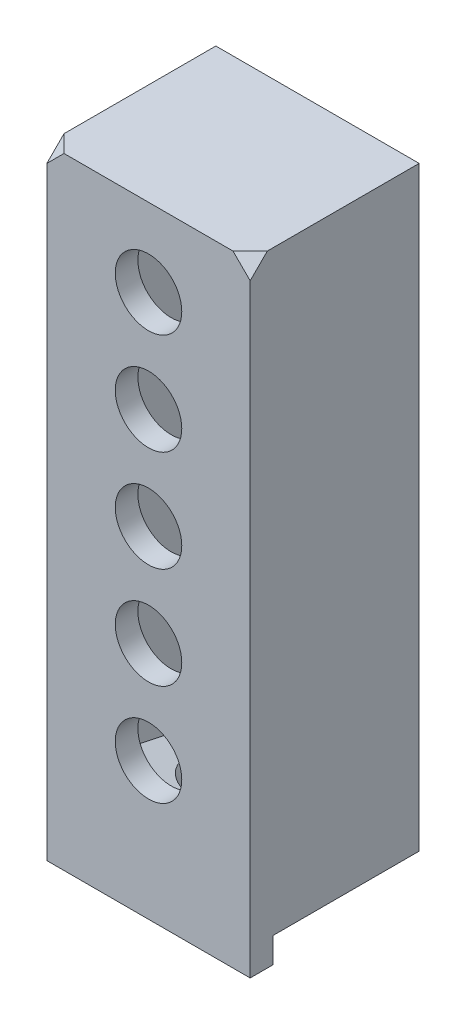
ISO-10303-21;
HEADER;
FILE_DESCRIPTION(('STEP AP214'),'2;1');
FILE_NAME('part.step','',(''),(''),'','','');
FILE_SCHEMA(('AUTOMOTIVE_DESIGN { 1 0 10303 214 1 1 1 1 }'));
ENDSEC;
DATA;
#1=APPLICATION_CONTEXT('core data for automotive mechanical design processes');
#2=APPLICATION_PROTOCOL_DEFINITION('international standard','automotive_design',2000,#1);
#3=PRODUCT_CONTEXT('',#1,'mechanical');
#4=PRODUCT('Part','Part','',(#3));
#5=PRODUCT_RELATED_PRODUCT_CATEGORY('part','',(#4));
#6=PRODUCT_DEFINITION_FORMATION('','',#4);
#7=PRODUCT_DEFINITION_CONTEXT('part definition',#1,'design');
#8=PRODUCT_DEFINITION('design','',#6,#7);
#9=PRODUCT_DEFINITION_SHAPE('','',#8);
#10=(LENGTH_UNIT() NAMED_UNIT(*) SI_UNIT(.MILLI.,.METRE.));
#11=(NAMED_UNIT(*) PLANE_ANGLE_UNIT() SI_UNIT($,.RADIAN.));
#12=(NAMED_UNIT(*) SI_UNIT($,.STERADIAN.) SOLID_ANGLE_UNIT());
#13=UNCERTAINTY_MEASURE_WITH_UNIT(LENGTH_MEASURE(1.E-05),#10,'distance_accuracy_value','');
#14=(GEOMETRIC_REPRESENTATION_CONTEXT(3) GLOBAL_UNCERTAINTY_ASSIGNED_CONTEXT((#13)) GLOBAL_UNIT_ASSIGNED_CONTEXT((#10,
#11,#12)) REPRESENTATION_CONTEXT('',''));
#15=CARTESIAN_POINT('',(0.,0.,0.));
#16=DIRECTION('',(0.,0.,1.));
#17=DIRECTION('',(1.,0.,0.));
#18=AXIS2_PLACEMENT_3D('',#15,#16,#17);
#19=CARTESIAN_POINT('',(0.,0.,0.));
#20=DIRECTION('',(0.,0.,-1.));
#21=DIRECTION('',(-1.,0.,0.));
#22=AXIS2_PLACEMENT_3D('',#19,#20,#21);
#23=PLANE('',#22);
#24=CARTESIAN_POINT('',(0.,7.62,0.));
#25=DIRECTION('',(0.,0.,1.));
#26=DIRECTION('',(1.,0.,0.));
#27=AXIS2_PLACEMENT_3D('',#24,#25,#26);
#28=CIRCLE('',#27,2.5);
#29=CARTESIAN_POINT('',(2.5,7.62,0.));
#30=VERTEX_POINT('',#29);
#31=EDGE_CURVE('E293',#30,#30,#28,.T.);
#32=ORIENTED_EDGE('',*,*,#31,.T.);
#33=EDGE_LOOP('',(#32));
#34=FACE_BOUND('',#33,.T.);
#35=CARTESIAN_POINT('',(0.,-7.62,0.));
#36=DIRECTION('',(0.,0.,1.));
#37=DIRECTION('',(1.,0.,0.));
#38=AXIS2_PLACEMENT_3D('',#35,#36,#37);
#39=CIRCLE('',#38,2.5);
#40=CARTESIAN_POINT('',(2.5,-7.62,0.));
#41=VERTEX_POINT('',#40);
#42=EDGE_CURVE('E305',#41,#41,#39,.T.);
#43=ORIENTED_EDGE('',*,*,#42,.T.);
#44=EDGE_LOOP('',(#43));
#45=FACE_BOUND('',#44,.T.);
#46=CARTESIAN_POINT('',(0.,-15.24,0.));
#47=DIRECTION('',(0.,0.,1.));
#48=DIRECTION('',(1.,0.,0.));
#49=AXIS2_PLACEMENT_3D('',#46,#47,#48);
#50=CIRCLE('',#49,2.5);
#51=CARTESIAN_POINT('',(2.5,-15.24,0.));
#52=VERTEX_POINT('',#51);
#53=EDGE_CURVE('E311',#52,#52,#50,.T.);
#54=ORIENTED_EDGE('',*,*,#53,.T.);
#55=EDGE_LOOP('',(#54));
#56=FACE_BOUND('',#55,.T.);
#57=CARTESIAN_POINT('',(0.,0.,0.));
#58=DIRECTION('',(0.,0.,1.));
#59=DIRECTION('',(1.,0.,0.));
#60=AXIS2_PLACEMENT_3D('',#57,#58,#59);
#61=CIRCLE('',#60,2.5);
#62=CARTESIAN_POINT('',(2.5,0.,0.));
#63=VERTEX_POINT('',#62);
#64=EDGE_CURVE('E299',#63,#63,#61,.T.);
#65=ORIENTED_EDGE('',*,*,#64,.T.);
#66=EDGE_LOOP('',(#65));
#67=FACE_BOUND('',#66,.T.);
#68=CARTESIAN_POINT('',(0.,15.24,0.));
#69=DIRECTION('',(0.,0.,1.));
#70=DIRECTION('',(1.,0.,0.));
#71=AXIS2_PLACEMENT_3D('',#68,#69,#70);
#72=CIRCLE('',#71,2.5);
#73=CARTESIAN_POINT('',(2.5,15.24,0.));
#74=VERTEX_POINT('',#73);
#75=EDGE_CURVE('E282',#74,#74,#72,.T.);
#76=ORIENTED_EDGE('',*,*,#75,.T.);
#77=EDGE_LOOP('',(#76));
#78=FACE_BOUND('',#77,.T.);
#79=DIRECTION('',(0.,1.,0.));
#80=VECTOR('',#79,1.);
#81=CARTESIAN_POINT('',(6.35,-22.3755,0.));
#82=LINE('',#81,#80);
#83=CARTESIAN_POINT('',(6.34999999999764,-19.3375110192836,0.));
#84=VERTEX_POINT('',#83);
#85=CARTESIAN_POINT('',(6.35,19.812,0.));
#86=VERTEX_POINT('',#85);
#87=EDGE_CURVE('E320',#84,#86,#82,.T.);
#88=ORIENTED_EDGE('',*,*,#87,.F.);
#89=DIRECTION('',(-1.,0.,0.));
#90=VECTOR('',#89,1.);
#91=CARTESIAN_POINT('',(500000.,-19.3375110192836,0.));
#92=LINE('',#91,#90);
#93=CARTESIAN_POINT('',(-6.37000000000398,-19.3375110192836,0.));
#94=VERTEX_POINT('',#93);
#95=EDGE_CURVE('E240',#84,#94,#92,.T.);
#96=ORIENTED_EDGE('',*,*,#95,.T.);
#97=CARTESIAN_POINT('',(-6.37000000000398,-20.6344110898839,0.));
#98=DIRECTION('',(0.,0.,-1.));
#99=DIRECTION('',(0.,-1.,0.));
#100=AXIS2_PLACEMENT_3D('',#97,#98,#99);
#101=ELLIPSE('',#100,1.29690007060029,1.27);
#102=CARTESIAN_POINT('',(-7.64,-20.6344110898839,0.));
#103=VERTEX_POINT('',#102);
#104=EDGE_CURVE('E76',#94,#103,#101,.F.);
#105=ORIENTED_EDGE('',*,*,#104,.T.);
#106=DIRECTION('',(0.,1.,0.));
#107=VECTOR('',#106,1.);
#108=CARTESIAN_POINT('',(-7.64,-15.5275110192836,0.));
#109=LINE('',#108,#107);
#110=CARTESIAN_POINT('',(-7.64,-15.5275110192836,0.));
#111=VERTEX_POINT('',#110);
#112=EDGE_CURVE('E83',#103,#111,#109,.T.);
#113=ORIENTED_EDGE('',*,*,#112,.T.);
#114=DIRECTION('',(-1.,0.,0.));
#115=VECTOR('',#114,1.);
#116=CARTESIAN_POINT('',(7.64100000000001,-15.5275110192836,0.));
#117=LINE('',#116,#115);
#118=CARTESIAN_POINT('',(-6.34999999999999,-15.5275110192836,0.));
#119=VERTEX_POINT('',#118);
#120=EDGE_CURVE('E194',#119,#111,#117,.T.);
#121=ORIENTED_EDGE('',*,*,#120,.F.);
#122=DIRECTION('',(0.,-1.,0.));
#123=VECTOR('',#122,1.);
#124=CARTESIAN_POINT('',(-6.35,-22.3755,0.));
#125=LINE('',#124,#123);
#126=CARTESIAN_POINT('',(-6.35,19.812,0.));
#127=VERTEX_POINT('',#126);
#128=EDGE_CURVE('E207',#127,#119,#125,.T.);
#129=ORIENTED_EDGE('',*,*,#128,.F.);
#130=DIRECTION('',(-1.,0.,0.));
#131=VECTOR('',#130,1.);
#132=CARTESIAN_POINT('',(-6.35,19.812,0.));
#133=LINE('',#132,#131);
#134=EDGE_CURVE('E322',#86,#127,#133,.T.);
#135=ORIENTED_EDGE('',*,*,#134,.F.);
#136=EDGE_LOOP('',(#88,#96,#105,#113,#121,#129,#135));
#137=FACE_BOUND('',#136,.T.);
#138=ADVANCED_FACE('F68',(#34,#45,#56,#67,#78,#137),#23,.T.);
#139=CARTESIAN_POINT('',(-6.35,19.812,-11.));
#140=DIRECTION('',(-1.,0.,0.));
#141=DIRECTION('',(0.,-1.,0.));
#142=AXIS2_PLACEMENT_3D('',#139,#140,#141);
#143=PLANE('',#142);
#144=DIRECTION('',(0.,0.,1.));
#145=VECTOR('',#144,1.);
#146=CARTESIAN_POINT('',(-6.34999999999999,-15.5275110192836,-3.81));
#147=LINE('',#146,#145);
#148=CARTESIAN_POINT('',(-6.34999999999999,-15.5275110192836,-3.81));
#149=VERTEX_POINT('',#148);
#150=EDGE_CURVE('E191',#149,#119,#147,.T.);
#151=ORIENTED_EDGE('',*,*,#150,.F.);
#152=DIRECTION('',(0.,1.,0.));
#153=VECTOR('',#152,1.);
#154=CARTESIAN_POINT('',(-6.34999999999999,-15.5275110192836,-3.81));
#155=LINE('',#154,#153);
#156=CARTESIAN_POINT('',(-6.35,-20.1258308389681,-3.81));
#157=VERTEX_POINT('',#156);
#158=EDGE_CURVE('E198',#157,#149,#155,.T.);
#159=ORIENTED_EDGE('',*,*,#158,.F.);
#160=DIRECTION('',(0.,0.202616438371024,0.979258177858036));
#161=VECTOR('',#160,1.);
#162=CARTESIAN_POINT('',(-6.35,-19.3375110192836,0.));
#163=LINE('',#162,#161);
#164=CARTESIAN_POINT('',(-6.35,-21.6135,-11.));
#165=VERTEX_POINT('',#164);
#166=EDGE_CURVE('E237',#165,#157,#163,.T.);
#167=ORIENTED_EDGE('',*,*,#166,.F.);
#168=DIRECTION('',(0.,-1.,0.));
#169=VECTOR('',#168,1.);
#170=CARTESIAN_POINT('',(-6.35,19.812,-11.));
#171=LINE('',#170,#169);
#172=CARTESIAN_POINT('',(-6.35,19.812,-11.));
#173=VERTEX_POINT('',#172);
#174=EDGE_CURVE('E239',#173,#165,#171,.T.);
#175=ORIENTED_EDGE('',*,*,#174,.F.);
#176=DIRECTION('',(0.,0.,1.));
#177=VECTOR('',#176,1.);
#178=CARTESIAN_POINT('',(-6.35,19.812,-11.));
#179=LINE('',#178,#177);
#180=EDGE_CURVE('E255',#173,#127,#179,.T.);
#181=ORIENTED_EDGE('',*,*,#180,.T.);
#182=ORIENTED_EDGE('',*,*,#128,.T.);
#183=EDGE_LOOP('',(#151,#159,#167,#175,#181,#182));
#184=FACE_BOUND('',#183,.T.);
#185=ADVANCED_FACE('F205',(#184),#143,.F.);
#186=CARTESIAN_POINT('',(6.34999999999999,19.812,-11.));
#187=DIRECTION('',(1.,0.,0.));
#188=DIRECTION('',(0.,1.,0.));
#189=AXIS2_PLACEMENT_3D('',#186,#187,#188);
#190=PLANE('',#189);
#191=DIRECTION('',(0.,0.202616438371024,0.979258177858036));
#192=VECTOR('',#191,1.);
#193=CARTESIAN_POINT('',(6.34999999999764,-19.3375110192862,-1.22378209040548E-11));
#194=LINE('',#193,#192);
#195=CARTESIAN_POINT('',(6.34999999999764,-21.6135,-11.));
#196=VERTEX_POINT('',#195);
#197=EDGE_CURVE('E236',#196,#84,#194,.T.);
#198=ORIENTED_EDGE('',*,*,#197,.T.);
#199=ORIENTED_EDGE('',*,*,#87,.T.);
#200=DIRECTION('',(0.,0.,1.));
#201=VECTOR('',#200,1.);
#202=CARTESIAN_POINT('',(6.34999999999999,19.812,-11.));
#203=LINE('',#202,#201);
#204=CARTESIAN_POINT('',(6.34999999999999,19.812,-11.));
#205=VERTEX_POINT('',#204);
#206=EDGE_CURVE('E254',#205,#86,#203,.T.);
#207=ORIENTED_EDGE('',*,*,#206,.F.);
#208=DIRECTION('',(0.,1.,0.));
#209=VECTOR('',#208,1.);
#210=CARTESIAN_POINT('',(6.34999999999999,19.812,-11.));
#211=LINE('',#210,#209);
#212=EDGE_CURVE('E249',#196,#205,#211,.T.);
#213=ORIENTED_EDGE('',*,*,#212,.F.);
#214=EDGE_LOOP('',(#198,#199,#207,#213));
#215=FACE_BOUND('',#214,.T.);
#216=ADVANCED_FACE('F406',(#215),#190,.F.);
#217=CARTESIAN_POINT('',(7.64,19.812,-11.));
#218=DIRECTION('',(1.,0.,0.));
#219=DIRECTION('',(0.,1.,0.));
#220=AXIS2_PLACEMENT_3D('',#217,#218,#219);
#221=PLANE('',#220);
#222=DIRECTION('',(0.,0.,1.));
#223=VECTOR('',#222,1.);
#224=CARTESIAN_POINT('',(7.64,21.102,-11.));
#225=LINE('',#224,#223);
#226=CARTESIAN_POINT('',(7.64,21.102,-11.));
#227=VERTEX_POINT('',#226);
#228=CARTESIAN_POINT('',(7.64,21.102,0.409999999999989));
#229=VERTEX_POINT('',#228);
#230=EDGE_CURVE('E283',#227,#229,#225,.T.);
#231=ORIENTED_EDGE('',*,*,#230,.T.);
#232=DIRECTION('',(0.,-0.707106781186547,0.707106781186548));
#233=VECTOR('',#232,1.);
#234=CARTESIAN_POINT('',(7.63999999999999,26.162,-4.65000000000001));
#235=LINE('',#234,#233);
#236=CARTESIAN_POINT('',(7.64,19.812,1.7));
#237=VERTEX_POINT('',#236);
#238=EDGE_CURVE('E339',#229,#237,#235,.T.);
#239=ORIENTED_EDGE('',*,*,#238,.T.);
#240=DIRECTION('',(0.,1.,0.));
#241=VECTOR('',#240,1.);
#242=CARTESIAN_POINT('',(7.64,19.812,1.7));
#243=LINE('',#242,#241);
#244=CARTESIAN_POINT('',(7.64,-25.5705,1.7));
#245=VERTEX_POINT('',#244);
#246=EDGE_CURVE('E275',#245,#237,#243,.T.);
#247=ORIENTED_EDGE('',*,*,#246,.F.);
#248=DIRECTION('',(0.,0.,1.));
#249=VECTOR('',#248,1.);
#250=CARTESIAN_POINT('',(7.64,-25.5705,1.7));
#251=LINE('',#250,#249);
#252=CARTESIAN_POINT('',(7.64,-25.5705,0.));
#253=VERTEX_POINT('',#252);
#254=EDGE_CURVE('E222',#253,#245,#251,.T.);
#255=ORIENTED_EDGE('',*,*,#254,.F.);
#256=DIRECTION('',(0.,1.,0.));
#257=VECTOR('',#256,1.);
#258=CARTESIAN_POINT('',(7.64,-25.5705,0.));
#259=LINE('',#258,#257);
#260=CARTESIAN_POINT('',(7.64,-23.6655,0.));
#261=VERTEX_POINT('',#260);
#262=EDGE_CURVE('E228',#253,#261,#259,.T.);
#263=ORIENTED_EDGE('',*,*,#262,.T.);
#264=DIRECTION('',(0.,0.,1.));
#265=VECTOR('',#264,1.);
#266=CARTESIAN_POINT('',(7.64,-23.6655,-11.));
#267=LINE('',#266,#265);
#268=CARTESIAN_POINT('',(7.64,-23.6655,-11.));
#269=VERTEX_POINT('',#268);
#270=EDGE_CURVE('E286',#269,#261,#267,.T.);
#271=ORIENTED_EDGE('',*,*,#270,.F.);
#272=DIRECTION('',(0.,1.,0.));
#273=VECTOR('',#272,1.);
#274=CARTESIAN_POINT('',(7.64,19.812,-11.));
#275=LINE('',#274,#273);
#276=EDGE_CURVE('E267',#269,#227,#275,.T.);
#277=ORIENTED_EDGE('',*,*,#276,.T.);
#278=EDGE_LOOP('',(#231,#239,#247,#255,#263,#271,#277));
#279=FACE_BOUND('',#278,.T.);
#280=ADVANCED_FACE('F381',(#279),#221,.T.);
#281=CARTESIAN_POINT('',(-6.35,21.102,-11.));
#282=DIRECTION('',(0.,1.,0.));
#283=DIRECTION('',(0.,0.,1.));
#284=AXIS2_PLACEMENT_3D('',#281,#282,#283);
#285=PLANE('',#284);
#286=DIRECTION('',(-1.,0.,0.));
#287=VECTOR('',#286,1.);
#288=CARTESIAN_POINT('',(-6.35,21.102,1.7));
#289=LINE('',#288,#287);
#290=CARTESIAN_POINT('',(6.34999999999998,21.102,1.7));
#291=VERTEX_POINT('',#290);
#292=CARTESIAN_POINT('',(-6.34999999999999,21.102,1.7));
#293=VERTEX_POINT('',#292);
#294=EDGE_CURVE('E264',#291,#293,#289,.T.);
#295=ORIENTED_EDGE('',*,*,#294,.F.);
#296=DIRECTION('',(0.707106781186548,0.,-0.707106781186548));
#297=VECTOR('',#296,1.);
#298=CARTESIAN_POINT('',(6.34999999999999,21.102,1.69999999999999));
#299=LINE('',#298,#297);
#300=EDGE_CURVE('E334',#291,#229,#299,.T.);
#301=ORIENTED_EDGE('',*,*,#300,.T.);
#302=ORIENTED_EDGE('',*,*,#230,.F.);
#303=DIRECTION('',(-1.,0.,0.));
#304=VECTOR('',#303,1.);
#305=CARTESIAN_POINT('',(-6.35,21.102,-11.));
#306=LINE('',#305,#304);
#307=CARTESIAN_POINT('',(-7.64,21.102,-11.));
#308=VERTEX_POINT('',#307);
#309=EDGE_CURVE('E270',#227,#308,#306,.T.);
#310=ORIENTED_EDGE('',*,*,#309,.T.);
#311=DIRECTION('',(0.,0.,1.));
#312=VECTOR('',#311,1.);
#313=CARTESIAN_POINT('',(-7.64,21.102,-11.));
#314=LINE('',#313,#312);
#315=CARTESIAN_POINT('',(-7.64,21.102,0.409999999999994));
#316=VERTEX_POINT('',#315);
#317=EDGE_CURVE('E279',#308,#316,#314,.T.);
#318=ORIENTED_EDGE('',*,*,#317,.T.);
#319=DIRECTION('',(0.707106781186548,0.,0.707106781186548));
#320=VECTOR('',#319,1.);
#321=CARTESIAN_POINT('',(-12.7,21.102,-4.65));
#322=LINE('',#321,#320);
#323=EDGE_CURVE('E331',#316,#293,#322,.T.);
#324=ORIENTED_EDGE('',*,*,#323,.T.);
#325=EDGE_LOOP('',(#295,#301,#302,#310,#318,#324));
#326=FACE_BOUND('',#325,.T.);
#327=ADVANCED_FACE('F366',(#326),#285,.T.);
#328=CARTESIAN_POINT('',(-7.64,19.812,-11.));
#329=DIRECTION('',(-1.,0.,0.));
#330=DIRECTION('',(0.,-1.,0.));
#331=AXIS2_PLACEMENT_3D('',#328,#329,#330);
#332=PLANE('',#331);
#333=ORIENTED_EDGE('',*,*,#112,.F.);
#334=DIRECTION('',(0.,0.202616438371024,0.979258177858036));
#335=VECTOR('',#334,1.);
#336=CARTESIAN_POINT('',(-7.64,-21.3694887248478,-3.5526771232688));
#337=LINE('',#336,#335);
#338=CARTESIAN_POINT('',(-7.64,-21.4227309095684,-3.81));
#339=VERTEX_POINT('',#338);
#340=EDGE_CURVE('E353',#103,#339,#337,.F.);
#341=ORIENTED_EDGE('',*,*,#340,.T.);
#342=DIRECTION('',(0.,-1.,0.));
#343=VECTOR('',#342,1.);
#344=CARTESIAN_POINT('',(-7.64,-15.5275110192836,-3.81));
#345=LINE('',#344,#343);
#346=CARTESIAN_POINT('',(-7.64,-15.5275110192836,-3.81));
#347=VERTEX_POINT('',#346);
#348=EDGE_CURVE('E90',#347,#339,#345,.T.);
#349=ORIENTED_EDGE('',*,*,#348,.F.);
#350=DIRECTION('',(0.,0.,-1.));
#351=VECTOR('',#350,1.);
#352=CARTESIAN_POINT('',(-7.64,-15.5275110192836,-3.81));
#353=LINE('',#352,#351);
#354=EDGE_CURVE('E193',#111,#347,#353,.T.);
#355=ORIENTED_EDGE('',*,*,#354,.F.);
#356=EDGE_LOOP('',(#333,#341,#349,#355));
#357=FACE_BOUND('',#356,.T.);
#358=DIRECTION('',(0.,-1.,0.));
#359=VECTOR('',#358,1.);
#360=CARTESIAN_POINT('',(-7.64,19.812,1.7));
#361=LINE('',#360,#359);
#362=CARTESIAN_POINT('',(-7.64,19.812,1.7));
#363=VERTEX_POINT('',#362);
#364=CARTESIAN_POINT('',(-7.64,-25.5705,1.7));
#365=VERTEX_POINT('',#364);
#366=EDGE_CURVE('E257',#363,#365,#361,.T.);
#367=ORIENTED_EDGE('',*,*,#366,.F.);
#368=DIRECTION('',(0.,0.707106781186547,-0.707106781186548));
#369=VECTOR('',#368,1.);
#370=CARTESIAN_POINT('',(-7.64,26.162,-4.65000000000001));
#371=LINE('',#370,#369);
#372=EDGE_CURVE('E328',#363,#316,#371,.T.);
#373=ORIENTED_EDGE('',*,*,#372,.T.);
#374=ORIENTED_EDGE('',*,*,#317,.F.);
#375=DIRECTION('',(0.,-1.,0.));
#376=VECTOR('',#375,1.);
#377=CARTESIAN_POINT('',(-7.64,19.812,-11.));
#378=LINE('',#377,#376);
#379=CARTESIAN_POINT('',(-7.64,-23.6655,-11.));
#380=VERTEX_POINT('',#379);
#381=EDGE_CURVE('E260',#308,#380,#378,.T.);
#382=ORIENTED_EDGE('',*,*,#381,.T.);
#383=DIRECTION('',(0.,0.,1.));
#384=VECTOR('',#383,1.);
#385=CARTESIAN_POINT('',(-7.64,-23.6655,-11.));
#386=LINE('',#385,#384);
#387=CARTESIAN_POINT('',(-7.64,-23.6655,0.));
#388=VERTEX_POINT('',#387);
#389=EDGE_CURVE('E273',#380,#388,#386,.T.);
#390=ORIENTED_EDGE('',*,*,#389,.T.);
#391=DIRECTION('',(0.,1.,0.));
#392=VECTOR('',#391,1.);
#393=CARTESIAN_POINT('',(-7.64,-25.5705,0.));
#394=LINE('',#393,#392);
#395=CARTESIAN_POINT('',(-7.64,-25.5705,0.));
#396=VERTEX_POINT('',#395);
#397=EDGE_CURVE('E233',#396,#388,#394,.T.);
#398=ORIENTED_EDGE('',*,*,#397,.F.);
#399=DIRECTION('',(0.,0.,-1.));
#400=VECTOR('',#399,1.);
#401=CARTESIAN_POINT('',(-7.64,-25.5705,1.7));
#402=LINE('',#401,#400);
#403=EDGE_CURVE('E217',#365,#396,#402,.T.);
#404=ORIENTED_EDGE('',*,*,#403,.F.);
#405=EDGE_LOOP('',(#367,#373,#374,#382,#390,#398,#404));
#406=FACE_BOUND('',#405,.T.);
#407=ADVANCED_FACE('F360',(#357,#406),#332,.T.);
#408=CARTESIAN_POINT('',(0.,0.,1.7));
#409=DIRECTION('',(0.,0.,-1.));
#410=DIRECTION('',(-1.,0.,0.));
#411=AXIS2_PLACEMENT_3D('',#408,#409,#410);
#412=PLANE('',#411);
#413=DIRECTION('',(0.707106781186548,-0.707106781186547,0.));
#414=VECTOR('',#413,1.);
#415=CARTESIAN_POINT('',(13.726,13.726,1.7));
#416=LINE('',#415,#414);
#417=EDGE_CURVE('E337',#291,#237,#416,.T.);
#418=ORIENTED_EDGE('',*,*,#417,.F.);
#419=ORIENTED_EDGE('',*,*,#294,.T.);
#420=DIRECTION('',(0.707106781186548,0.707106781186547,0.));
#421=VECTOR('',#420,1.);
#422=CARTESIAN_POINT('',(-13.726,13.726,1.7));
#423=LINE('',#422,#421);
#424=EDGE_CURVE('E325',#363,#293,#423,.T.);
#425=ORIENTED_EDGE('',*,*,#424,.F.);
#426=ORIENTED_EDGE('',*,*,#366,.T.);
#427=DIRECTION('',(-1.,0.,0.));
#428=VECTOR('',#427,1.);
#429=CARTESIAN_POINT('',(-7.64,-25.5705,1.7));
#430=LINE('',#429,#428);
#431=EDGE_CURVE('E225',#245,#365,#430,.T.);
#432=ORIENTED_EDGE('',*,*,#431,.F.);
#433=ORIENTED_EDGE('',*,*,#246,.T.);
#434=EDGE_LOOP('',(#418,#419,#425,#426,#432,#433));
#435=FACE_BOUND('',#434,.T.);
#436=CARTESIAN_POINT('',(0.,-15.24,1.7));
#437=DIRECTION('',(0.,0.,1.));
#438=DIRECTION('',(1.,0.,0.));
#439=AXIS2_PLACEMENT_3D('',#436,#437,#438);
#440=CIRCLE('',#439,2.5);
#441=CARTESIAN_POINT('',(2.5,-15.24,1.7));
#442=VERTEX_POINT('',#441);
#443=EDGE_CURVE('E314',#442,#442,#440,.T.);
#444=ORIENTED_EDGE('',*,*,#443,.F.);
#445=EDGE_LOOP('',(#444));
#446=FACE_BOUND('',#445,.T.);
#447=CARTESIAN_POINT('',(0.,-7.62,1.7));
#448=DIRECTION('',(0.,0.,1.));
#449=DIRECTION('',(1.,0.,0.));
#450=AXIS2_PLACEMENT_3D('',#447,#448,#449);
#451=CIRCLE('',#450,2.5);
#452=CARTESIAN_POINT('',(2.5,-7.62,1.7));
#453=VERTEX_POINT('',#452);
#454=EDGE_CURVE('E308',#453,#453,#451,.T.);
#455=ORIENTED_EDGE('',*,*,#454,.F.);
#456=EDGE_LOOP('',(#455));
#457=FACE_BOUND('',#456,.T.);
#458=CARTESIAN_POINT('',(0.,0.,1.7));
#459=DIRECTION('',(0.,0.,1.));
#460=DIRECTION('',(1.,0.,0.));
#461=AXIS2_PLACEMENT_3D('',#458,#459,#460);
#462=CIRCLE('',#461,2.5);
#463=CARTESIAN_POINT('',(2.5,0.,1.7));
#464=VERTEX_POINT('',#463);
#465=EDGE_CURVE('E302',#464,#464,#462,.T.);
#466=ORIENTED_EDGE('',*,*,#465,.F.);
#467=EDGE_LOOP('',(#466));
#468=FACE_BOUND('',#467,.T.);
#469=CARTESIAN_POINT('',(0.,7.62,1.7));
#470=DIRECTION('',(0.,0.,1.));
#471=DIRECTION('',(1.,0.,0.));
#472=AXIS2_PLACEMENT_3D('',#469,#470,#471);
#473=CIRCLE('',#472,2.5);
#474=CARTESIAN_POINT('',(2.5,7.62,1.7));
#475=VERTEX_POINT('',#474);
#476=EDGE_CURVE('E296',#475,#475,#473,.T.);
#477=ORIENTED_EDGE('',*,*,#476,.F.);
#478=EDGE_LOOP('',(#477));
#479=FACE_BOUND('',#478,.T.);
#480=CARTESIAN_POINT('',(0.,15.24,1.7));
#481=DIRECTION('',(0.,0.,1.));
#482=DIRECTION('',(1.,0.,0.));
#483=AXIS2_PLACEMENT_3D('',#480,#481,#482);
#484=CIRCLE('',#483,2.5);
#485=CARTESIAN_POINT('',(2.5,15.24,1.7));
#486=VERTEX_POINT('',#485);
#487=EDGE_CURVE('E290',#486,#486,#484,.T.);
#488=ORIENTED_EDGE('',*,*,#487,.F.);
#489=EDGE_LOOP('',(#488));
#490=FACE_BOUND('',#489,.T.);
#491=ADVANCED_FACE('F365',(#435,#446,#457,#468,#479,#490),#412,.F.);
#492=CARTESIAN_POINT('',(0.,-15.24,1.7));
#493=DIRECTION('',(0.,0.,-1.));
#494=DIRECTION('',(-1.,0.,0.));
#495=AXIS2_PLACEMENT_3D('',#492,#493,#494);
#496=CYLINDRICAL_SURFACE('',#495,2.5);
#497=ORIENTED_EDGE('',*,*,#443,.T.);
#498=EDGE_LOOP('',(#497));
#499=FACE_BOUND('',#498,.T.);
#500=ORIENTED_EDGE('',*,*,#53,.F.);
#501=EDGE_LOOP('',(#500));
#502=FACE_BOUND('',#501,.T.);
#503=ADVANCED_FACE('F530',(#499,#502),#496,.F.);
#504=CARTESIAN_POINT('',(0.,-7.62,1.7));
#505=DIRECTION('',(0.,0.,-1.));
#506=DIRECTION('',(-1.,0.,0.));
#507=AXIS2_PLACEMENT_3D('',#504,#505,#506);
#508=CYLINDRICAL_SURFACE('',#507,2.5);
#509=ORIENTED_EDGE('',*,*,#454,.T.);
#510=EDGE_LOOP('',(#509));
#511=FACE_BOUND('',#510,.T.);
#512=ORIENTED_EDGE('',*,*,#42,.F.);
#513=EDGE_LOOP('',(#512));
#514=FACE_BOUND('',#513,.T.);
#515=ADVANCED_FACE('F604',(#511,#514),#508,.F.);
#516=CARTESIAN_POINT('',(0.,0.,1.7));
#517=DIRECTION('',(0.,0.,-1.));
#518=DIRECTION('',(-1.,0.,0.));
#519=AXIS2_PLACEMENT_3D('',#516,#517,#518);
#520=CYLINDRICAL_SURFACE('',#519,2.5);
#521=ORIENTED_EDGE('',*,*,#465,.T.);
#522=EDGE_LOOP('',(#521));
#523=FACE_BOUND('',#522,.T.);
#524=ORIENTED_EDGE('',*,*,#64,.F.);
#525=EDGE_LOOP('',(#524));
#526=FACE_BOUND('',#525,.T.);
#527=ADVANCED_FACE('F594',(#523,#526),#520,.F.);
#528=CARTESIAN_POINT('',(0.,7.62,1.7));
#529=DIRECTION('',(0.,0.,-1.));
#530=DIRECTION('',(-1.,0.,0.));
#531=AXIS2_PLACEMENT_3D('',#528,#529,#530);
#532=CYLINDRICAL_SURFACE('',#531,2.5);
#533=ORIENTED_EDGE('',*,*,#476,.T.);
#534=EDGE_LOOP('',(#533));
#535=FACE_BOUND('',#534,.T.);
#536=ORIENTED_EDGE('',*,*,#31,.F.);
#537=EDGE_LOOP('',(#536));
#538=FACE_BOUND('',#537,.T.);
#539=ADVANCED_FACE('F584',(#535,#538),#532,.F.);
#540=CARTESIAN_POINT('',(0.,15.24,1.7));
#541=DIRECTION('',(0.,0.,-1.));
#542=DIRECTION('',(-1.,0.,0.));
#543=AXIS2_PLACEMENT_3D('',#540,#541,#542);
#544=CYLINDRICAL_SURFACE('',#543,2.5);
#545=ORIENTED_EDGE('',*,*,#487,.T.);
#546=EDGE_LOOP('',(#545));
#547=FACE_BOUND('',#546,.T.);
#548=ORIENTED_EDGE('',*,*,#75,.F.);
#549=EDGE_LOOP('',(#548));
#550=FACE_BOUND('',#549,.T.);
#551=ADVANCED_FACE('F430',(#547,#550),#544,.F.);
#552=CARTESIAN_POINT('',(-6.34999999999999,-23.6655,-11.));
#553=DIRECTION('',(0.,-1.,0.));
#554=DIRECTION('',(0.,0.,-1.));
#555=AXIS2_PLACEMENT_3D('',#552,#553,#554);
#556=PLANE('',#555);
#557=CARTESIAN_POINT('',(0.,-23.6655,-5.45702234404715));
#558=DIRECTION('',(0.,-1.,0.));
#559=DIRECTION('',(0.,0.,-1.));
#560=AXIS2_PLACEMENT_3D('',#557,#558,#559);
#561=ELLIPSE('',#560,1.73702914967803,1.701);
#562=CARTESIAN_POINT('',(0.465143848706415,-23.6655,-7.12784517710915));
#563=VERTEX_POINT('',#562);
#564=CARTESIAN_POINT('',(-0.465143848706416,-23.6655,-7.12784517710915));
#565=VERTEX_POINT('',#564);
#566=EDGE_CURVE('E213',#563,#565,#561,.T.);
#567=ORIENTED_EDGE('',*,*,#566,.F.);
#568=CARTESIAN_POINT('',(0.,-23.6655,-5.72403470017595));
#569=DIRECTION('',(0.,-1.,0.));
#570=DIRECTION('',(0.,0.,-1.));
#571=AXIS2_PLACEMENT_3D('',#568,#569,#570);
#572=ELLIPSE('',#571,1.48453634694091,1.4300363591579);
#573=EDGE_CURVE('E345',#563,#565,#572,.F.);
#574=ORIENTED_EDGE('',*,*,#573,.T.);
#575=EDGE_LOOP('',(#567,#574));
#576=FACE_BOUND('',#575,.T.);
#577=DIRECTION('',(1.,0.,0.));
#578=VECTOR('',#577,1.);
#579=CARTESIAN_POINT('',(-7.64,-23.6655,0.));
#580=LINE('',#579,#578);
#581=EDGE_CURVE('E216',#388,#261,#580,.T.);
#582=ORIENTED_EDGE('',*,*,#581,.F.);
#583=ORIENTED_EDGE('',*,*,#389,.F.);
#584=DIRECTION('',(1.,0.,0.));
#585=VECTOR('',#584,1.);
#586=CARTESIAN_POINT('',(-6.34999999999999,-23.6655,-11.));
#587=LINE('',#586,#585);
#588=EDGE_CURVE('E263',#380,#269,#587,.T.);
#589=ORIENTED_EDGE('',*,*,#588,.T.);
#590=ORIENTED_EDGE('',*,*,#270,.T.);
#591=EDGE_LOOP('',(#582,#583,#589,#590));
#592=FACE_BOUND('',#591,.T.);
#593=ADVANCED_FACE('F427',(#576,#592),#556,.T.);
#594=CARTESIAN_POINT('',(0.,0.,-11.));
#595=DIRECTION('',(0.,0.,1.));
#596=DIRECTION('',(1.,0.,0.));
#597=AXIS2_PLACEMENT_3D('',#594,#595,#596);
#598=PLANE('',#597);
#599=ORIENTED_EDGE('',*,*,#174,.T.);
#600=DIRECTION('',(-1.,0.,0.));
#601=VECTOR('',#600,1.);
#602=CARTESIAN_POINT('',(500000.,-21.6135,-11.));
#603=LINE('',#602,#601);
#604=EDGE_CURVE('E241',#196,#165,#603,.T.);
#605=ORIENTED_EDGE('',*,*,#604,.F.);
#606=ORIENTED_EDGE('',*,*,#212,.T.);
#607=DIRECTION('',(-1.,0.,0.));
#608=VECTOR('',#607,1.);
#609=CARTESIAN_POINT('',(-6.35,19.812,-11.));
#610=LINE('',#609,#608);
#611=EDGE_CURVE('E251',#205,#173,#610,.T.);
#612=ORIENTED_EDGE('',*,*,#611,.T.);
#613=EDGE_LOOP('',(#599,#605,#606,#612));
#614=FACE_BOUND('',#613,.T.);
#615=ORIENTED_EDGE('',*,*,#381,.F.);
#616=ORIENTED_EDGE('',*,*,#309,.F.);
#617=ORIENTED_EDGE('',*,*,#276,.F.);
#618=ORIENTED_EDGE('',*,*,#588,.F.);
#619=EDGE_LOOP('',(#615,#616,#617,#618));
#620=FACE_BOUND('',#619,.T.);
#621=ADVANCED_FACE('F397',(#614,#620),#598,.F.);
#622=CARTESIAN_POINT('',(-6.35,19.812,-11.));
#623=DIRECTION('',(0.,1.,0.));
#624=DIRECTION('',(0.,0.,1.));
#625=AXIS2_PLACEMENT_3D('',#622,#623,#624);
#626=PLANE('',#625);
#627=ORIENTED_EDGE('',*,*,#134,.T.);
#628=ORIENTED_EDGE('',*,*,#180,.F.);
#629=ORIENTED_EDGE('',*,*,#611,.F.);
#630=ORIENTED_EDGE('',*,*,#206,.T.);
#631=EDGE_LOOP('',(#627,#628,#629,#630));
#632=FACE_BOUND('',#631,.T.);
#633=ADVANCED_FACE('F389',(#632),#626,.F.);
#634=CARTESIAN_POINT('',(-9.71733333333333,9.71733333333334,9.71733333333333));
#635=DIRECTION('',(-0.577350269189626,0.577350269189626,0.577350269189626));
#636=DIRECTION('',(0.,-0.707106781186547,0.707106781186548));
#637=AXIS2_PLACEMENT_3D('',#634,#635,#636);
#638=PLANE('',#637);
#639=ORIENTED_EDGE('',*,*,#372,.F.);
#640=ORIENTED_EDGE('',*,*,#424,.T.);
#641=ORIENTED_EDGE('',*,*,#323,.F.);
#642=EDGE_LOOP('',(#639,#640,#641));
#643=FACE_BOUND('',#642,.T.);
#644=ADVANCED_FACE('F386',(#643),#638,.T.);
#645=CARTESIAN_POINT('',(9.71733333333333,9.71733333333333,9.71733333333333));
#646=DIRECTION('',(0.577350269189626,0.577350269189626,0.577350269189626));
#647=DIRECTION('',(0.,-0.707106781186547,0.707106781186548));
#648=AXIS2_PLACEMENT_3D('',#645,#646,#647);
#649=PLANE('',#648);
#650=ORIENTED_EDGE('',*,*,#300,.F.);
#651=ORIENTED_EDGE('',*,*,#417,.T.);
#652=ORIENTED_EDGE('',*,*,#238,.F.);
#653=EDGE_LOOP('',(#650,#651,#652));
#654=FACE_BOUND('',#653,.T.);
#655=ADVANCED_FACE('F388',(#654),#649,.T.);
#656=CARTESIAN_POINT('',(500000.,-19.3375110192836,0.));
#657=DIRECTION('',(0.,-0.979258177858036,0.202616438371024));
#658=DIRECTION('',(0.,-0.202616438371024,-0.979258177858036));
#659=AXIS2_PLACEMENT_3D('',#656,#657,#658);
#660=PLANE('',#659);
#661=CARTESIAN_POINT('',(0.,-20.5979383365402,-6.09172566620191));
#662=DIRECTION('',(0.,-0.979258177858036,0.202616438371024));
#663=DIRECTION('',(0.,-0.202616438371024,-0.979258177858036));
#664=AXIS2_PLACEMENT_3D('',#661,#662,#663);
#665=CIRCLE('',#664,4.12978714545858);
#666=CARTESIAN_POINT('',(0.,-21.4347010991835,-10.1358535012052));
#667=VERTEX_POINT('',#666);
#668=EDGE_CURVE('E347',#667,#667,#665,.T.);
#669=ORIENTED_EDGE('',*,*,#668,.T.);
#670=EDGE_LOOP('',(#669));
#671=FACE_BOUND('',#670,.T.);
#672=DIRECTION('',(-1.,0.,0.));
#673=VECTOR('',#672,1.);
#674=CARTESIAN_POINT('',(7.64100000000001,-20.1258308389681,-3.81));
#675=LINE('',#674,#673);
#676=CARTESIAN_POINT('',(-6.37000000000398,-20.1258308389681,-3.81));
#677=VERTEX_POINT('',#676);
#678=EDGE_CURVE('E195',#157,#677,#675,.T.);
#679=ORIENTED_EDGE('',*,*,#678,.T.);
#680=DIRECTION('',(0.,0.202616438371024,0.979258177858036));
#681=VECTOR('',#680,1.);
#682=CARTESIAN_POINT('',(-6.37000000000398,-19.3375110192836,0.));
#683=LINE('',#682,#681);
#684=EDGE_CURVE('E350',#677,#94,#683,.T.);
#685=ORIENTED_EDGE('',*,*,#684,.T.);
#686=ORIENTED_EDGE('',*,*,#95,.F.);
#687=ORIENTED_EDGE('',*,*,#197,.F.);
#688=ORIENTED_EDGE('',*,*,#604,.T.);
#689=ORIENTED_EDGE('',*,*,#166,.T.);
#690=EDGE_LOOP('',(#679,#685,#686,#687,#688,#689));
#691=FACE_BOUND('',#690,.T.);
#692=ADVANCED_FACE('F395',(#671,#691),#660,.F.);
#693=CARTESIAN_POINT('',(-7.64,-25.5705,0.));
#694=DIRECTION('',(0.,0.,1.));
#695=DIRECTION('',(1.,0.,0.));
#696=AXIS2_PLACEMENT_3D('',#693,#694,#695);
#697=PLANE('',#696);
#698=ORIENTED_EDGE('',*,*,#581,.T.);
#699=ORIENTED_EDGE('',*,*,#262,.F.);
#700=DIRECTION('',(1.,0.,0.));
#701=VECTOR('',#700,1.);
#702=CARTESIAN_POINT('',(-7.64,-25.5705,0.));
#703=LINE('',#702,#701);
#704=EDGE_CURVE('E220',#396,#253,#703,.T.);
#705=ORIENTED_EDGE('',*,*,#704,.F.);
#706=ORIENTED_EDGE('',*,*,#397,.T.);
#707=EDGE_LOOP('',(#698,#699,#705,#706));
#708=FACE_BOUND('',#707,.T.);
#709=ADVANCED_FACE('F435',(#708),#697,.F.);
#710=CARTESIAN_POINT('',(0.,-25.5705,0.));
#711=DIRECTION('',(0.,-1.,0.));
#712=DIRECTION('',(0.,0.,-1.));
#713=AXIS2_PLACEMENT_3D('',#710,#711,#712);
#714=PLANE('',#713);
#715=ORIENTED_EDGE('',*,*,#403,.T.);
#716=ORIENTED_EDGE('',*,*,#704,.T.);
#717=ORIENTED_EDGE('',*,*,#254,.T.);
#718=ORIENTED_EDGE('',*,*,#431,.T.);
#719=EDGE_LOOP('',(#715,#716,#717,#718));
#720=FACE_BOUND('',#719,.T.);
#721=ADVANCED_FACE('F377',(#720),#714,.T.);
#722=CARTESIAN_POINT('',(0.,-26.9123452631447,-4.78522379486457));
#723=DIRECTION('',(0.,0.979258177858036,-0.202616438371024));
#724=DIRECTION('',(0.,0.202616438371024,0.979258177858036));
#725=AXIS2_PLACEMENT_3D('',#722,#723,#724);
#726=CYLINDRICAL_SURFACE('',#725,1.701);
#727=ORIENTED_EDGE('',*,*,#566,.T.);
#728=CARTESIAN_POINT('',(0.,-23.3339856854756,-5.52561533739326));
#729=DIRECTION('',(0.,-0.979258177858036,0.202616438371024));
#730=DIRECTION('',(0.,-0.202616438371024,-0.979258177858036));
#731=AXIS2_PLACEMENT_3D('',#728,#729,#730);
#732=CIRCLE('',#731,1.701);
#733=EDGE_CURVE('E342',#565,#563,#732,.F.);
#734=ORIENTED_EDGE('',*,*,#733,.T.);
#735=EDGE_LOOP('',(#727,#734));
#736=FACE_BOUND('',#735,.T.);
#737=ADVANCED_FACE('F413',(#736),#726,.F.);
#738=CARTESIAN_POINT('',(0.,-23.3339856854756,-5.52561533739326));
#739=DIRECTION('',(0.,0.979258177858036,-0.202616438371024));
#740=DIRECTION('',(0.,0.202616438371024,0.979258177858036));
#741=AXIS2_PLACEMENT_3D('',#738,#739,#740);
#742=CONICAL_SURFACE('',#741,1.701,0.71558499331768);
#743=ORIENTED_EDGE('',*,*,#668,.F.);
#744=EDGE_LOOP('',(#743));
#745=FACE_BOUND('',#744,.T.);
#746=ORIENTED_EDGE('',*,*,#573,.F.);
#747=ORIENTED_EDGE('',*,*,#733,.F.);
#748=EDGE_LOOP('',(#746,#747));
#749=FACE_BOUND('',#748,.T.);
#750=ADVANCED_FACE('F411',(#745,#749),#742,.F.);
#751=CARTESIAN_POINT('',(7.64100000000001,-15.5275110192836,-3.81));
#752=DIRECTION('',(0.,0.,-1.));
#753=DIRECTION('',(-1.,0.,0.));
#754=AXIS2_PLACEMENT_3D('',#751,#752,#753);
#755=PLANE('',#754);
#756=ORIENTED_EDGE('',*,*,#158,.T.);
#757=DIRECTION('',(-1.,0.,0.));
#758=VECTOR('',#757,1.);
#759=CARTESIAN_POINT('',(7.64100000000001,-15.5275110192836,-3.81));
#760=LINE('',#759,#758);
#761=EDGE_CURVE('E187',#149,#347,#760,.T.);
#762=ORIENTED_EDGE('',*,*,#761,.T.);
#763=ORIENTED_EDGE('',*,*,#348,.T.);
#764=CARTESIAN_POINT('',(-6.37000000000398,-21.4227309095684,-3.81));
#765=DIRECTION('',(0.,0.,-1.));
#766=DIRECTION('',(0.,-1.,0.));
#767=AXIS2_PLACEMENT_3D('',#764,#765,#766);
#768=ELLIPSE('',#767,1.29690007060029,1.27);
#769=EDGE_CURVE('E14',#339,#677,#768,.T.);
#770=ORIENTED_EDGE('',*,*,#769,.T.);
#771=ORIENTED_EDGE('',*,*,#678,.F.);
#772=EDGE_LOOP('',(#756,#762,#763,#770,#771));
#773=FACE_BOUND('',#772,.T.);
#774=ADVANCED_FACE('F199',(#773),#755,.F.);
#775=CARTESIAN_POINT('',(7.64100000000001,-15.5275110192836,-3.81));
#776=DIRECTION('',(0.,1.,0.));
#777=DIRECTION('',(-1.,0.,0.));
#778=AXIS2_PLACEMENT_3D('',#775,#776,#777);
#779=PLANE('',#778);
#780=ORIENTED_EDGE('',*,*,#150,.T.);
#781=ORIENTED_EDGE('',*,*,#120,.T.);
#782=ORIENTED_EDGE('',*,*,#354,.T.);
#783=ORIENTED_EDGE('',*,*,#761,.F.);
#784=EDGE_LOOP('',(#780,#781,#782,#783));
#785=FACE_BOUND('',#784,.T.);
#786=ADVANCED_FACE('F189',(#785),#779,.F.);
#787=CARTESIAN_POINT('',(-6.37000000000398,-20.5811689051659,0.257322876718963));
#788=DIRECTION('',(0.,-0.202616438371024,-0.979258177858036));
#789=DIRECTION('',(0.,0.979258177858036,-0.202616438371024));
#790=AXIS2_PLACEMENT_3D('',#787,#788,#789);
#791=CYLINDRICAL_SURFACE('',#790,1.27);
#792=ORIENTED_EDGE('',*,*,#769,.F.);
#793=ORIENTED_EDGE('',*,*,#340,.F.);
#794=ORIENTED_EDGE('',*,*,#104,.F.);
#795=ORIENTED_EDGE('',*,*,#684,.F.);
#796=EDGE_LOOP('',(#792,#793,#794,#795));
#797=FACE_BOUND('',#796,.T.);
#798=ADVANCED_FACE('F70',(#797),#791,.T.);
#799=CLOSED_SHELL('',(#138,#185,#216,#280,#327,#407,#491,#503,#515,#527,#539,#551,#593,#621,
#633,#644,#655,#692,#709,#721,#737,#750,#774,#786,#798));
#800=MANIFOLD_SOLID_BREP('B2',#799);
#801=ADVANCED_BREP_SHAPE_REPRESENTATION('',(#18,#800),#14);
#802=SHAPE_DEFINITION_REPRESENTATION(#9,#801);
ENDSEC;
END-ISO-10303-21;
